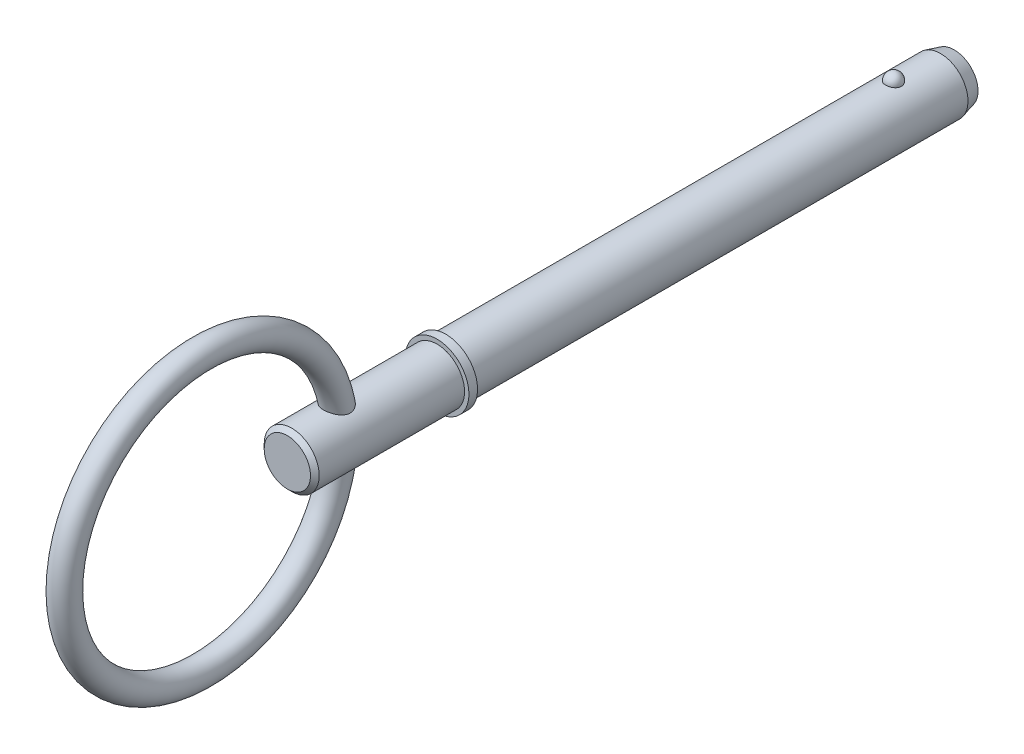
ISO-10303-21;
HEADER;
FILE_DESCRIPTION(('STEP AP214'),'2;1');
FILE_NAME('part.step','',(''),(''),'','','');
FILE_SCHEMA(('AUTOMOTIVE_DESIGN { 1 0 10303 214 1 1 1 1 }'));
ENDSEC;
DATA;
#1=APPLICATION_CONTEXT('core data for automotive mechanical design processes');
#2=APPLICATION_PROTOCOL_DEFINITION('international standard','automotive_design',2000,#1);
#3=PRODUCT_CONTEXT('',#1,'mechanical');
#4=PRODUCT('Part','Part','',(#3));
#5=PRODUCT_RELATED_PRODUCT_CATEGORY('part','',(#4));
#6=PRODUCT_DEFINITION_FORMATION('','',#4);
#7=PRODUCT_DEFINITION_CONTEXT('part definition',#1,'design');
#8=PRODUCT_DEFINITION('design','',#6,#7);
#9=PRODUCT_DEFINITION_SHAPE('','',#8);
#10=(LENGTH_UNIT() NAMED_UNIT(*) SI_UNIT(.MILLI.,.METRE.));
#11=(NAMED_UNIT(*) PLANE_ANGLE_UNIT() SI_UNIT($,.RADIAN.));
#12=(NAMED_UNIT(*) SI_UNIT($,.STERADIAN.) SOLID_ANGLE_UNIT());
#13=UNCERTAINTY_MEASURE_WITH_UNIT(LENGTH_MEASURE(1.E-05),#10,'distance_accuracy_value','');
#14=(GEOMETRIC_REPRESENTATION_CONTEXT(3) GLOBAL_UNCERTAINTY_ASSIGNED_CONTEXT((#13)) GLOBAL_UNIT_ASSIGNED_CONTEXT((#10,
#11,#12)) REPRESENTATION_CONTEXT('',''));
#15=CARTESIAN_POINT('',(0.,0.,0.));
#16=DIRECTION('',(0.,0.,1.));
#17=DIRECTION('',(1.,0.,0.));
#18=AXIS2_PLACEMENT_3D('',#15,#16,#17);
#19=CARTESIAN_POINT('',(0.,0.,50.8));
#20=DIRECTION('',(0.,0.,-1.));
#21=DIRECTION('',(-1.,0.,0.));
#22=AXIS2_PLACEMENT_3D('',#19,#20,#21);
#23=CYLINDRICAL_SURFACE('',#22,3.175);
#24=CARTESIAN_POINT('',(0.90060722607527,3.0445905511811,-0.91));
#25=CARTESIAN_POINT('',(0.90060646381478,3.04459122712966,-0.859144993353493));
#26=CARTESIAN_POINT('',(0.896466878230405,3.04582460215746,-0.808280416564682));
#27=CARTESIAN_POINT('',(0.88000740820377,3.05062019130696,-0.707994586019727));
#28=CARTESIAN_POINT('',(0.86768478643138,3.05418318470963,-0.658573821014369));
#29=CARTESIAN_POINT('',(0.835170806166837,3.06323316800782,-0.56260427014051));
#30=CARTESIAN_POINT('',(0.814982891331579,3.0687193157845,-0.516054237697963));
#31=CARTESIAN_POINT('',(0.767236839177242,3.08100268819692,-0.427093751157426));
#32=CARTESIAN_POINT('',(0.739678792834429,3.08779989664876,-0.38468324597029));
#33=CARTESIAN_POINT('',(0.677715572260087,3.10198953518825,-0.304951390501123));
#34=CARTESIAN_POINT('',(0.643275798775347,3.10938485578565,-0.267657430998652));
#35=CARTESIAN_POINT('',(0.568522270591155,3.12391647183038,-0.199446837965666));
#36=CARTESIAN_POINT('',(0.528208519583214,3.13105276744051,-0.16853020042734));
#37=CARTESIAN_POINT('',(0.442911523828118,3.14425008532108,-0.114021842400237));
#38=CARTESIAN_POINT('',(0.397942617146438,3.15031426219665,-0.0904084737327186));
#39=CARTESIAN_POINT('',(0.304493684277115,3.16071443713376,-0.0510610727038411));
#40=CARTESIAN_POINT('',(0.256014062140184,3.1650506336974,-0.0353261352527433));
#41=CARTESIAN_POINT('',(0.15789136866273,3.17144549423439,-0.01241518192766));
#42=CARTESIAN_POINT('',(0.108287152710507,3.1735453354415,-0.00508422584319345));
#43=CARTESIAN_POINT('',(0.0085070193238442,3.17538048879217,0.00133254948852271));
#44=CARTESIAN_POINT('',(-0.0416688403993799,3.17511603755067,0.0004191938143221));
#45=CARTESIAN_POINT('',(-0.140377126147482,3.17227395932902,-0.00954840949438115));
#46=CARTESIAN_POINT('',(-0.188922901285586,3.16973088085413,-0.018481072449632));
#47=CARTESIAN_POINT('',(-0.283780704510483,3.16265029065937,-0.044065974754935));
#48=CARTESIAN_POINT('',(-0.330092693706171,3.15811274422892,-0.0607183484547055));
#49=CARTESIAN_POINT('',(-0.419493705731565,3.1474895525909,-0.101406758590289));
#50=CARTESIAN_POINT('',(-0.462561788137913,3.14139480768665,-0.125486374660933));
#51=CARTESIAN_POINT('',(-0.54404237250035,3.12831396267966,-0.180346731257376));
#52=CARTESIAN_POINT('',(-0.582454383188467,3.12132776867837,-0.211128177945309));
#53=CARTESIAN_POINT('',(-0.654371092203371,3.10705591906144,-0.279257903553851));
#54=CARTESIAN_POINT('',(-0.687763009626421,3.09976707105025,-0.316724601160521));
#55=CARTESIAN_POINT('',(-0.747869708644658,3.08581767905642,-0.396782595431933));
#56=CARTESIAN_POINT('',(-0.774583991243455,3.07915718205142,-0.43937427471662));
#57=CARTESIAN_POINT('',(-0.820959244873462,3.06712152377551,-0.529074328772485));
#58=CARTESIAN_POINT('',(-0.840531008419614,3.06176288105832,-0.576231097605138));
#59=CARTESIAN_POINT('',(-0.871672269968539,3.0530437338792,-0.673291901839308));
#60=CARTESIAN_POINT('',(-0.883242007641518,3.04968316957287,-0.723195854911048));
#61=CARTESIAN_POINT('',(-0.898057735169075,3.04535343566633,-0.824104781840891));
#62=CARTESIAN_POINT('',(-0.901339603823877,3.04437395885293,-0.875104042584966));
#63=CARTESIAN_POINT('',(-0.89960137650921,3.04488803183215,-0.976947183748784));
#64=CARTESIAN_POINT('',(-0.894581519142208,3.04638151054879,-1.02779106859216));
#65=CARTESIAN_POINT('',(-0.876414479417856,3.051656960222,-1.12760218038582));
#66=CARTESIAN_POINT('',(-0.863310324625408,3.05542681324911,-1.17657789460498));
#67=CARTESIAN_POINT('',(-0.82933491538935,3.06482253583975,-1.27156757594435));
#68=CARTESIAN_POINT('',(-0.808463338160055,3.07044848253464,-1.31758141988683));
#69=CARTESIAN_POINT('',(-0.759325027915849,3.08296842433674,-1.40563218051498));
#70=CARTESIAN_POINT('',(-0.731017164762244,3.08986940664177,-1.44764515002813));
#71=CARTESIAN_POINT('',(-0.667767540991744,3.10415201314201,-1.52624913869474));
#72=CARTESIAN_POINT('',(-0.632825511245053,3.11153365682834,-1.56283993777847));
#73=CARTESIAN_POINT('',(-0.557049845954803,3.12598962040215,-1.62972906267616));
#74=CARTESIAN_POINT('',(-0.516193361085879,3.13306260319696,-1.66000181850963));
#75=CARTESIAN_POINT('',(-0.42979268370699,3.14607829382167,-1.7132172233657));
#76=CARTESIAN_POINT('',(-0.384248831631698,3.15202108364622,-1.73616040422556));
#77=CARTESIAN_POINT('',(-0.290370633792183,3.16204171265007,-1.77380927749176));
#78=CARTESIAN_POINT('',(-0.242079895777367,3.16614263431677,-1.7886174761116));
#79=CARTESIAN_POINT('',(-0.14357928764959,3.17213528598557,-1.81001390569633));
#80=CARTESIAN_POINT('',(-0.0933696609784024,3.1740272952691,-1.81660317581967));
#81=CARTESIAN_POINT('',(0.00648182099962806,3.17537830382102,-1.82132177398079));
#82=CARTESIAN_POINT('',(0.0561153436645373,3.17488455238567,-1.81961539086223));
#83=CARTESIAN_POINT('',(0.154368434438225,3.1716260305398,-1.80816900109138));
#84=CARTESIAN_POINT('',(0.202988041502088,3.16886134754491,-1.79842930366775));
#85=CARTESIAN_POINT('',(0.29764238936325,3.16137318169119,-1.77125024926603));
#86=CARTESIAN_POINT('',(0.343686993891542,3.15665785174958,-1.75384292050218));
#87=CARTESIAN_POINT('',(0.432167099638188,3.14576631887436,-1.71181408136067));
#88=CARTESIAN_POINT('',(0.474602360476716,3.13959001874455,-1.68719209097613));
#89=CARTESIAN_POINT('',(0.555408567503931,3.1263159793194,-1.63094218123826));
#90=CARTESIAN_POINT('',(0.593703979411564,3.11920512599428,-1.59920888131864));
#91=CARTESIAN_POINT('',(0.664472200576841,3.10490064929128,-1.52981493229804));
#92=CARTESIAN_POINT('',(0.696944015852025,3.09770701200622,-1.49215327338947));
#93=CARTESIAN_POINT('',(0.755798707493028,3.08388169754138,-1.41116434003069));
#94=CARTESIAN_POINT('',(0.782059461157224,3.07726269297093,-1.36774610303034));
#95=CARTESIAN_POINT('',(0.827051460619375,3.06547790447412,-1.27699966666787));
#96=CARTESIAN_POINT('',(0.845785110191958,3.06031165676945,-1.22967272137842));
#97=CARTESIAN_POINT('',(0.873798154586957,3.05242388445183,-1.13728658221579));
#98=CARTESIAN_POINT('',(0.883833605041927,3.04951005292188,-1.09247132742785));
#99=CARTESIAN_POINT('',(0.897238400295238,3.0455931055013,-1.00177329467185));
#100=CARTESIAN_POINT('',(0.900607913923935,3.0445899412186,-0.955890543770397));
#101=CARTESIAN_POINT('',(0.90060722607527,3.0445905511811,-0.91));
#102=B_SPLINE_CURVE_WITH_KNOTS('',3,(#24,#25,#26,#27,#28,#29,#30,#31,#32,#33,#34,#35,#36,#37,
#38,#39,#40,#41,#42,#43,#44,#45,#46,#47,#48,#49,#50,#51,#52,#53,#54,#55,#56,#57,#58,#59,#60,#61,
#62,#63,#64,#65,#66,#67,#68,#69,#70,#71,#72,#73,#74,#75,#76,#77,#78,#79,#80,#81,#82,#83,#84,#85,
#86,#87,#88,#89,#90,#91,#92,#93,#94,#95,#96,#97,#98,#99,#100,#101),.UNSPECIFIED.,.T.,.F.,(4,2,2,
2,2,2,2,2,2,2,2,2,2,2,2,2,2,2,2,2,2,2,2,2,2,2,2,2,2,2,2,2,2,2,2,2,2,2,4),(0.,0.152400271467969,
0.304851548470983,0.45723615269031,0.609618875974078,0.762787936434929,0.915956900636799,
1.06866739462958,1.22136034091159,1.37119044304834,1.52100555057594,1.66858689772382,
1.81617081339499,1.9646377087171,2.1131202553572,2.26455561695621,2.41600229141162,
2.5692805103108,2.72255413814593,2.87516308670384,3.02776764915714,3.1795669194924,
3.33137249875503,3.48403607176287,3.63670583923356,3.78998198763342,3.94324701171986,
4.09453370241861,4.24580126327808,4.39408543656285,4.5423639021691,4.69002878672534,
4.83770349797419,4.9877312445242,5.13778457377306,5.29058018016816,5.44332695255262,
5.58085340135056,5.71837636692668),.UNSPECIFIED.);
#103=CARTESIAN_POINT('',(0.90060722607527,3.0445905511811,-0.91));
#104=VERTEX_POINT('',#103);
#105=EDGE_CURVE('E100',#104,#104,#102,.T.);
#106=ORIENTED_EDGE('',*,*,#105,.T.);
#107=EDGE_LOOP('',(#106));
#108=FACE_BOUND('',#107,.T.);
#109=CARTESIAN_POINT('',(0.,0.,-6.33399999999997));
#110=DIRECTION('',(0.,0.,-1.));
#111=DIRECTION('',(-1.,0.,0.));
#112=AXIS2_PLACEMENT_3D('',#109,#110,#111);
#113=CIRCLE('',#112,3.175);
#114=CARTESIAN_POINT('',(-3.175,0.,-6.33399999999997));
#115=VERTEX_POINT('',#114);
#116=EDGE_CURVE('E108',#115,#115,#113,.F.);
#117=ORIENTED_EDGE('',*,*,#116,.T.);
#118=EDGE_LOOP('',(#117));
#119=FACE_BOUND('',#118,.T.);
#120=CARTESIAN_POINT('',(0.,0.,50.8));
#121=DIRECTION('',(0.,0.,1.));
#122=DIRECTION('',(1.,0.,0.));
#123=AXIS2_PLACEMENT_3D('',#120,#121,#122);
#124=CIRCLE('',#123,3.175);
#125=CARTESIAN_POINT('',(3.175,0.,50.8));
#126=VERTEX_POINT('',#125);
#127=EDGE_CURVE('E106',#126,#126,#124,.T.);
#128=ORIENTED_EDGE('',*,*,#127,.F.);
#129=EDGE_LOOP('',(#128));
#130=FACE_BOUND('',#129,.T.);
#131=ADVANCED_FACE('F39',(#108,#119,#130),#23,.T.);
#132=CARTESIAN_POINT('',(0.,0.,-7.92));
#133=DIRECTION('',(0.,0.,-1.));
#134=DIRECTION('',(-1.,0.,0.));
#135=AXIS2_PLACEMENT_3D('',#132,#133,#134);
#136=PLANE('',#135);
#137=CARTESIAN_POINT('',(0.,0.,-7.92));
#138=DIRECTION('',(0.,0.,-1.));
#139=DIRECTION('',(-1.,0.,0.));
#140=AXIS2_PLACEMENT_3D('',#137,#138,#139);
#141=CIRCLE('',#140,2.75003258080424);
#142=CARTESIAN_POINT('',(-2.75003258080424,0.,-7.92));
#143=VERTEX_POINT('',#142);
#144=EDGE_CURVE('E142',#143,#143,#141,.T.);
#145=ORIENTED_EDGE('',*,*,#144,.T.);
#146=EDGE_LOOP('',(#145));
#147=FACE_BOUND('',#146,.T.);
#148=ADVANCED_FACE('F86',(#147),#136,.T.);
#149=CARTESIAN_POINT('',(0.,0.,-7.92));
#150=DIRECTION('',(0.,0.,1.));
#151=DIRECTION('',(1.,0.,0.));
#152=AXIS2_PLACEMENT_3D('',#149,#150,#151);
#153=CONICAL_SURFACE('',#152,2.75003258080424,0.261799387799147);
#154=ORIENTED_EDGE('',*,*,#116,.F.);
#155=EDGE_LOOP('',(#154));
#156=FACE_BOUND('',#155,.T.);
#157=ORIENTED_EDGE('',*,*,#144,.F.);
#158=EDGE_LOOP('',(#157));
#159=FACE_BOUND('',#158,.T.);
#160=ADVANCED_FACE('F92',(#156,#159),#153,.T.);
#161=CARTESIAN_POINT('',(0.,3.175,-0.91));
#162=DIRECTION('',(0.,1.,0.));
#163=DIRECTION('',(0.,0.,-1.));
#164=AXIS2_PLACEMENT_3D('',#161,#162,#163);
#165=SPHERICAL_SURFACE('',#164,0.91);
#166=ORIENTED_EDGE('',*,*,#105,.F.);
#167=EDGE_LOOP('',(#166));
#168=FACE_BOUND('',#167,.T.);
#169=ADVANCED_FACE('F111',(#168),#165,.T.);
#170=CARTESIAN_POINT('',(0.,0.,50.8));
#171=DIRECTION('',(0.,0.,-1.));
#172=DIRECTION('',(-1.,0.,0.));
#173=AXIS2_PLACEMENT_3D('',#170,#171,#172);
#174=PLANE('',#173);
#175=ORIENTED_EDGE('',*,*,#127,.T.);
#176=EDGE_LOOP('',(#175));
#177=FACE_BOUND('',#176,.T.);
#178=CARTESIAN_POINT('',(0.,0.,50.8));
#179=DIRECTION('',(0.,0.,-1.));
#180=DIRECTION('',(-1.,0.,0.));
#181=AXIS2_PLACEMENT_3D('',#178,#179,#180);
#182=CIRCLE('',#181,3.675);
#183=CARTESIAN_POINT('',(-3.675,0.,50.8));
#184=VERTEX_POINT('',#183);
#185=EDGE_CURVE('E107',#184,#184,#182,.T.);
#186=ORIENTED_EDGE('',*,*,#185,.T.);
#187=EDGE_LOOP('',(#186));
#188=FACE_BOUND('',#187,.T.);
#189=ADVANCED_FACE('F115',(#177,#188),#174,.T.);
#190=CARTESIAN_POINT('',(0.,0.,33.7287874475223));
#191=DIRECTION('',(0.,0.,-1.));
#192=DIRECTION('',(-1.,0.,0.));
#193=AXIS2_PLACEMENT_3D('',#190,#191,#192);
#194=CYLINDRICAL_SURFACE('',#193,3.675);
#195=CARTESIAN_POINT('',(0.,0.,51.8));
#196=DIRECTION('',(0.,0.,-1.));
#197=DIRECTION('',(-1.,0.,0.));
#198=AXIS2_PLACEMENT_3D('',#195,#196,#197);
#199=CIRCLE('',#198,3.675);
#200=CARTESIAN_POINT('',(-3.675,0.,51.8));
#201=VERTEX_POINT('',#200);
#202=EDGE_CURVE('E132',#201,#201,#199,.T.);
#203=ORIENTED_EDGE('',*,*,#202,.T.);
#204=EDGE_LOOP('',(#203));
#205=FACE_BOUND('',#204,.T.);
#206=ORIENTED_EDGE('',*,*,#185,.F.);
#207=EDGE_LOOP('',(#206));
#208=FACE_BOUND('',#207,.T.);
#209=ADVANCED_FACE('F119',(#205,#208),#194,.T.);
#210=CARTESIAN_POINT('',(0.,3.675,51.8));
#211=DIRECTION('',(0.,0.,1.));
#212=DIRECTION('',(1.,0.,0.));
#213=AXIS2_PLACEMENT_3D('',#210,#211,#212);
#214=PLANE('',#213);
#215=CARTESIAN_POINT('',(0.,0.,51.8));
#216=DIRECTION('',(0.,0.,1.));
#217=DIRECTION('',(1.,0.,0.));
#218=AXIS2_PLACEMENT_3D('',#215,#216,#217);
#219=CIRCLE('',#218,3.175);
#220=CARTESIAN_POINT('',(3.175,0.,51.8));
#221=VERTEX_POINT('',#220);
#222=EDGE_CURVE('E110',#221,#221,#219,.T.);
#223=ORIENTED_EDGE('',*,*,#222,.F.);
#224=EDGE_LOOP('',(#223));
#225=FACE_BOUND('',#224,.T.);
#226=ORIENTED_EDGE('',*,*,#202,.F.);
#227=EDGE_LOOP('',(#226));
#228=FACE_BOUND('',#227,.T.);
#229=ADVANCED_FACE('F83',(#225,#228),#214,.T.);
#230=CARTESIAN_POINT('',(0.,0.,69.09));
#231=DIRECTION('',(0.,0.,-1.));
#232=DIRECTION('',(-1.,0.,0.));
#233=AXIS2_PLACEMENT_3D('',#230,#231,#232);
#234=CYLINDRICAL_SURFACE('',#233,3.175);
#235=CARTESIAN_POINT('',(-0.793622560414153,-3.07421343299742,62.0949618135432));
#236=CARTESIAN_POINT('',(-0.723928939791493,-3.09220199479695,62.0540743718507));
#237=CARTESIAN_POINT('',(-0.650537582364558,-3.10860299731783,62.0186572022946));
#238=CARTESIAN_POINT('',(-0.49822561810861,-3.13662262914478,61.95960803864));
#239=CARTESIAN_POINT('',(-0.419299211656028,-3.14823615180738,61.935988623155));
#240=CARTESIAN_POINT('',(-0.2580224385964,-3.16553731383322,61.9011787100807));
#241=CARTESIAN_POINT('',(-0.175668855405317,-3.17121924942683,61.8900001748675));
#242=CARTESIAN_POINT('',(-0.0100583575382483,-3.17606405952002,61.8804538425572));
#243=CARTESIAN_POINT('',(0.0731982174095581,-3.17522930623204,61.8820813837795));
#244=CARTESIAN_POINT('',(0.236345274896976,-3.16722178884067,61.8979075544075));
#245=CARTESIAN_POINT('',(0.316269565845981,-3.16018772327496,61.9118310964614));
#246=CARTESIAN_POINT('',(0.472429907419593,-3.14064183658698,61.9514871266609));
#247=CARTESIAN_POINT('',(0.548665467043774,-3.12812928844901,61.9772211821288));
#248=CARTESIAN_POINT('',(0.696533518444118,-3.0985857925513,62.0403145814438));
#249=CARTESIAN_POINT('',(0.768085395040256,-3.08149328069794,62.0778336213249));
#250=CARTESIAN_POINT('',(0.90366694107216,-3.04449595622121,62.163584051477));
#251=CARTESIAN_POINT('',(0.967693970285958,-3.02459016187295,62.2118191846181));
#252=CARTESIAN_POINT('',(1.08889306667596,-2.98315111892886,62.3200855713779));
#253=CARTESIAN_POINT('',(1.14572430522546,-2.96158491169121,62.3804869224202));
#254=CARTESIAN_POINT('',(1.24806454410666,-2.91993487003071,62.5106874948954));
#255=CARTESIAN_POINT('',(1.29357550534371,-2.89985077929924,62.5804850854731));
#256=CARTESIAN_POINT('',(1.37094214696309,-2.86407549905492,62.7262600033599));
#257=CARTESIAN_POINT('',(1.40307792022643,-2.84829687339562,62.8020662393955));
#258=CARTESIAN_POINT('',(1.45397574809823,-2.82265933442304,62.9589553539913));
#259=CARTESIAN_POINT('',(1.47274938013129,-2.81279529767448,63.0400335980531));
#260=CARTESIAN_POINT('',(1.49549698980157,-2.80076108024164,63.1979026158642));
#261=CARTESIAN_POINT('',(1.50056337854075,-2.79802369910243,63.2744958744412));
#262=CARTESIAN_POINT('',(1.49933665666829,-2.79868066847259,63.4275541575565));
#263=CARTESIAN_POINT('',(1.49304097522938,-2.80207640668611,63.5040191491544));
#264=CARTESIAN_POINT('',(1.46976618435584,-2.81435249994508,63.6552802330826));
#265=CARTESIAN_POINT('',(1.45272287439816,-2.82326580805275,63.7300634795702));
#266=CARTESIAN_POINT('',(1.40884990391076,-2.84541139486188,63.8760088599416));
#267=CARTESIAN_POINT('',(1.38201642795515,-2.85864535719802,63.9471695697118));
#268=CARTESIAN_POINT('',(1.31496449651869,-2.89016475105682,64.0946079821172));
#269=CARTESIAN_POINT('',(1.27338339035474,-2.90890132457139,64.1701693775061));
#270=CARTESIAN_POINT('',(1.17952729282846,-2.94820796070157,64.3139034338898));
#271=CARTESIAN_POINT('',(1.12723913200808,-2.96878026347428,64.3820668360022));
#272=CARTESIAN_POINT('',(1.00570728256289,-3.01228109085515,64.5173106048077));
#273=CARTESIAN_POINT('',(0.935174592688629,-3.03519170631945,64.5832498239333));
#274=CARTESIAN_POINT('',(0.782605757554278,-3.07805054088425,64.701321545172));
#275=CARTESIAN_POINT('',(0.700588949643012,-3.09800362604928,64.7534768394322));
#276=CARTESIAN_POINT('',(0.549003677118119,-3.12787153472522,64.8296423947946));
#277=CARTESIAN_POINT('',(0.481582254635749,-3.1390487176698,64.8574376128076));
#278=CARTESIAN_POINT('',(0.34269622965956,-3.15722518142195,64.9021563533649));
#279=CARTESIAN_POINT('',(0.271235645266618,-3.16422853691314,64.9190904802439));
#280=CARTESIAN_POINT('',(0.125873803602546,-3.17334230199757,64.9410622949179));
#281=CARTESIAN_POINT('',(0.0519637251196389,-3.17543249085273,64.9460508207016));
#282=CARTESIAN_POINT('',(-0.0956207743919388,-3.17441743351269,64.9436180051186));
#283=CARTESIAN_POINT('',(-0.169295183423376,-3.1713119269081,64.9361960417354));
#284=CARTESIAN_POINT('',(-0.309449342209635,-3.16061694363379,64.9103375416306));
#285=CARTESIAN_POINT('',(-0.376089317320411,-3.15332372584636,64.8926279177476));
#286=CARTESIAN_POINT('',(-0.505583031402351,-3.13517004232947,64.8477876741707));
#287=CARTESIAN_POINT('',(-0.568435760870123,-3.12430863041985,64.8206545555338));
#288=CARTESIAN_POINT('',(-0.694306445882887,-3.09887452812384,64.7555626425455));
#289=CARTESIAN_POINT('',(-0.7569075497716,-3.08406907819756,64.7168937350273));
#290=CARTESIAN_POINT('',(-0.875645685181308,-3.05248288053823,64.6313455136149));
#291=CARTESIAN_POINT('',(-0.931779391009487,-3.03570112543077,64.5844620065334));
#292=CARTESIAN_POINT('',(-1.0463923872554,-2.99832170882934,64.4747926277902));
#293=CARTESIAN_POINT('',(-1.10353654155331,-2.97757338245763,64.4106605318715));
#294=CARTESIAN_POINT('',(-1.20755858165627,-2.93692907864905,64.2742268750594));
#295=CARTESIAN_POINT('',(-1.25442453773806,-2.91703411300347,64.2019159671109));
#296=CARTESIAN_POINT('',(-1.34199791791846,-2.87788786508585,64.0412794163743));
#297=CARTESIAN_POINT('',(-1.38127718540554,-2.85900475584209,63.9520744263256));
#298=CARTESIAN_POINT('',(-1.44406659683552,-2.82781619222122,63.7671839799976));
#299=CARTESIAN_POINT('',(-1.46759319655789,-2.81550387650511,63.6715054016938));
#300=CARTESIAN_POINT('',(-1.49571801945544,-2.8006591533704,63.4845771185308));
#301=CARTESIAN_POINT('',(-1.50169726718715,-2.79741422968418,63.3935980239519));
#302=CARTESIAN_POINT('',(-1.49747735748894,-2.79967890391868,63.2121564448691));
#303=CARTESIAN_POINT('',(-1.48729863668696,-2.80517744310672,63.1216934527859));
#304=CARTESIAN_POINT('',(-1.45348639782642,-2.82281521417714,62.9584626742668));
#305=CARTESIAN_POINT('',(-1.43212237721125,-2.83382344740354,62.885088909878));
#306=CARTESIAN_POINT('',(-1.37828411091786,-2.86039426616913,62.7433903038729));
#307=CARTESIAN_POINT('',(-1.34580440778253,-2.87595908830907,62.6750679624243));
#308=CARTESIAN_POINT('',(-1.27066760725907,-2.90993532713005,62.5450336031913));
#309=CARTESIAN_POINT('',(-1.22800357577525,-2.92834868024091,62.483326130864));
#310=CARTESIAN_POINT('',(-1.13363307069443,-2.96615489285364,62.3677083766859));
#311=CARTESIAN_POINT('',(-1.08193541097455,-2.98554678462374,62.3137905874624));
#312=CARTESIAN_POINT('',(-0.990573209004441,-3.01675653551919,62.2323094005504));
#313=CARTESIAN_POINT('',(-0.95320938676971,-3.02880489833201,62.2022130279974));
#314=CARTESIAN_POINT('',(-0.875544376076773,-3.0521621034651,62.1457477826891));
#315=CARTESIAN_POINT('',(-0.83524283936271,-3.06347085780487,62.1193793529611));
#316=CARTESIAN_POINT('',(-0.793622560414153,-3.07421343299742,62.0949618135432));
#317=B_SPLINE_CURVE_WITH_KNOTS('',3,(#235,#236,#237,#238,#239,#240,#241,#242,#243,#244,#245,
#246,#247,#248,#249,#250,#251,#252,#253,#254,#255,#256,#257,#258,#259,#260,#261,#262,#263,#264,
#265,#266,#267,#268,#269,#270,#271,#272,#273,#274,#275,#276,#277,#278,#279,#280,#281,#282,#283,
#284,#285,#286,#287,#288,#289,#290,#291,#292,#293,#294,#295,#296,#297,#298,#299,#300,#301,#302,
#303,#304,#305,#306,#307,#308,#309,#310,#311,#312,#313,#314,#315,#316),.UNSPECIFIED.,.T.,.F.,(4,
2,2,2,2,2,2,2,2,2,2,2,2,2,2,2,2,2,2,2,2,2,2,2,2,2,2,2,2,2,2,2,2,2,2,2,2,2,2,2,4),(0.,
0.248167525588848,0.496599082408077,0.745269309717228,0.993849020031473,1.23700449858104,
1.48019225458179,1.7268289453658,1.97355191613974,2.22939388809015,2.48519151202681,
2.73532416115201,2.98523982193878,3.21455414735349,3.44392036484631,3.67466984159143,
3.90550934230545,4.16925064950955,4.43331832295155,4.72951976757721,5.02522832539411,
5.24564983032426,5.46585579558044,5.68696647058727,5.9080882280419,6.11521387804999,
6.32239449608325,6.54672206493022,6.77116447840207,7.03522663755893,7.29959368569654,
7.59590092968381,7.89189815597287,8.16387683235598,8.43551178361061,8.6660355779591,
8.89667271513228,9.12746733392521,9.35803801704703,9.50622339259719,9.6544263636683),.UNSPECIFIED.);
#318=CARTESIAN_POINT('',(-0.793622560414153,-3.07421343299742,62.0949618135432));
#319=VERTEX_POINT('',#318);
#320=EDGE_CURVE('E10',#319,#319,#317,.T.);
#321=ORIENTED_EDGE('',*,*,#320,.F.);
#322=EDGE_LOOP('',(#321));
#323=FACE_BOUND('',#322,.T.);
#324=CARTESIAN_POINT('',(-0.793622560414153,3.07421343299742,62.0949618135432));
#325=CARTESIAN_POINT('',(-0.864606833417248,3.05588589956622,62.1366128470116));
#326=CARTESIAN_POINT('',(-0.931875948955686,3.03587991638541,62.1840114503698));
#327=CARTESIAN_POINT('',(-1.05725170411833,2.99453227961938,62.2893775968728));
#328=CARTESIAN_POINT('',(-1.11534118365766,2.97318822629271,62.3473645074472));
#329=CARTESIAN_POINT('',(-1.22080462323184,2.93146441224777,62.472887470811));
#330=CARTESIAN_POINT('',(-1.26816209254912,2.91108617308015,62.5404379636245));
#331=CARTESIAN_POINT('',(-1.35052787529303,2.87380473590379,62.6835086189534));
#332=CARTESIAN_POINT('',(-1.38554886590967,2.85689797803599,62.7590204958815));
#333=CARTESIAN_POINT('',(-1.44074287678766,2.82945202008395,62.9122947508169));
#334=CARTESIAN_POINT('',(-1.46153301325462,2.81865228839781,62.9897872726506));
#335=CARTESIAN_POINT('',(-1.49023441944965,2.80358650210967,63.1477206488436));
#336=CARTESIAN_POINT('',(-1.49815016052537,2.79931817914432,63.2281604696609));
#337=CARTESIAN_POINT('',(-1.50117056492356,2.79769676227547,63.3840076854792));
#338=CARTESIAN_POINT('',(-1.49708260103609,2.79990784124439,63.4593985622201));
#339=CARTESIAN_POINT('',(-1.4784698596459,2.80977909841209,63.6084983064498));
#340=CARTESIAN_POINT('',(-1.46394166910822,2.8174410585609,63.6822066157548));
#341=CARTESIAN_POINT('',(-1.42400377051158,2.83784609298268,63.8313443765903));
#342=CARTESIAN_POINT('',(-1.39791960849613,2.85090002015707,63.9065484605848));
#343=CARTESIAN_POINT('',(-1.33585690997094,2.8805017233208,64.0520384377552));
#344=CARTESIAN_POINT('',(-1.29987052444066,2.89705226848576,64.1223203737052));
#345=CARTESIAN_POINT('',(-1.21229019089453,2.93489412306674,64.2677405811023));
#346=CARTESIAN_POINT('',(-1.15911759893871,2.95651988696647,64.3418449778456));
#347=CARTESIAN_POINT('',(-1.04143166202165,2.99999612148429,64.4803805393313));
#348=CARTESIAN_POINT('',(-0.976918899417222,3.0218465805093,64.544812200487));
#349=CARTESIAN_POINT('',(-0.84536841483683,3.06106710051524,64.6552302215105));
#350=CARTESIAN_POINT('',(-0.779466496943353,3.0786636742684,64.7024840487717));
#351=CARTESIAN_POINT('',(-0.640261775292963,3.11059085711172,64.7859540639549));
#352=CARTESIAN_POINT('',(-0.566963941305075,3.12492363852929,64.8221775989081));
#353=CARTESIAN_POINT('',(-0.413802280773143,3.14887886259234,64.8818109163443));
#354=CARTESIAN_POINT('',(-0.333888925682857,3.15846114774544,64.9051116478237));
#355=CARTESIAN_POINT('',(-0.170660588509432,3.17146222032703,64.9365717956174));
#356=CARTESIAN_POINT('',(-0.087349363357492,3.17488763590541,64.9447474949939));
#357=CARTESIAN_POINT('',(0.0674621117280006,3.17509166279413,64.9452317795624));
#358=CARTESIAN_POINT('',(0.138963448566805,3.17274321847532,64.9396242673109));
#359=CARTESIAN_POINT('',(0.279855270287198,3.16342998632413,64.9171581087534));
#360=CARTESIAN_POINT('',(0.349245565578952,3.15646478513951,64.9002984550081));
#361=CARTESIAN_POINT('',(0.483013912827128,3.13875920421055,64.8567119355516));
#362=CARTESIAN_POINT('',(0.547455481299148,3.12808257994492,64.8301513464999));
#363=CARTESIAN_POINT('',(0.671431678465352,3.10383639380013,64.7683782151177));
#364=CARTESIAN_POINT('',(0.730964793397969,3.09026594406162,64.7331630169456));
#365=CARTESIAN_POINT('',(0.852308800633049,3.05919023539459,64.6498716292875));
#366=CARTESIAN_POINT('',(0.913284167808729,3.04140021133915,64.6006877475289));
#367=CARTESIAN_POINT('',(1.0273242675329,3.00480015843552,64.4941850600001));
#368=CARTESIAN_POINT('',(1.08038247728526,2.98598930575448,64.4368596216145));
#369=CARTESIAN_POINT('',(1.18657794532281,2.94557646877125,64.3046952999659));
#370=CARTESIAN_POINT('',(1.23812372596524,2.92405810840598,64.2285445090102));
#371=CARTESIAN_POINT('',(1.32862928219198,2.88406370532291,64.0682796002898));
#372=CARTESIAN_POINT('',(1.36758013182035,2.86558982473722,63.9841598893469));
#373=CARTESIAN_POINT('',(1.43274280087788,2.83359383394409,63.8061421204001));
#374=CARTESIAN_POINT('',(1.45837682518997,2.82030175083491,63.7119863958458));
#375=CARTESIAN_POINT('',(1.49241322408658,2.80245006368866,63.5198495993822));
#376=CARTESIAN_POINT('',(1.50084951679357,2.79787327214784,63.4218764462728));
#377=CARTESIAN_POINT('',(1.49914798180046,2.79877932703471,63.2405073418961));
#378=CARTESIAN_POINT('',(1.49154990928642,2.80288682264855,63.157078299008));
#379=CARTESIAN_POINT('',(1.46253136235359,2.81813655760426,62.9933228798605));
#380=CARTESIAN_POINT('',(1.44111368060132,2.82927737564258,62.9129958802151));
#381=CARTESIAN_POINT('',(1.38785163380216,2.85574398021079,62.7657200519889));
#382=CARTESIAN_POINT('',(1.3572264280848,2.87055627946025,62.6982302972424));
#383=CARTESIAN_POINT('',(1.28612163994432,2.90310901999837,62.5694446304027));
#384=CARTESIAN_POINT('',(1.24564038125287,2.92084995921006,62.508149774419));
#385=CARTESIAN_POINT('',(1.1532082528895,2.95860856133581,62.3894756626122));
#386=CARTESIAN_POINT('',(1.10072548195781,2.97869868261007,62.3325343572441));
#387=CARTESIAN_POINT('',(0.98711836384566,3.01825121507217,62.2277702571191));
#388=CARTESIAN_POINT('',(0.925990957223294,3.03771340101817,62.1799507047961));
#389=CARTESIAN_POINT('',(0.792065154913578,3.07545294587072,62.0913571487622));
#390=CARTESIAN_POINT('',(0.718757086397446,3.0935612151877,62.0512781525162));
#391=CARTESIAN_POINT('',(0.565747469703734,3.12516438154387,61.9833730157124));
#392=CARTESIAN_POINT('',(0.486046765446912,3.13865988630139,61.9555452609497));
#393=CARTESIAN_POINT('',(0.323293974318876,3.15955163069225,61.9130890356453));
#394=CARTESIAN_POINT('',(0.240283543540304,3.16700771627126,61.8983309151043));
#395=CARTESIAN_POINT('',(0.0726303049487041,3.17527774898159,61.8819853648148));
#396=CARTESIAN_POINT('',(-0.012012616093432,3.17609123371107,61.8803988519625));
#397=CARTESIAN_POINT('',(-0.177340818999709,3.17108555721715,61.8902649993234));
#398=CARTESIAN_POINT('',(-0.258061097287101,3.16549698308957,61.9012643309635));
#399=CARTESIAN_POINT('',(-0.416230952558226,3.1486007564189,61.9352506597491));
#400=CARTESIAN_POINT('',(-0.493684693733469,3.13730063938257,61.9582218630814));
#401=CARTESIAN_POINT('',(-0.607599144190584,3.11657538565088,62.0018364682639));
#402=CARTESIAN_POINT('',(-0.645999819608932,3.10882447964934,62.0183691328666));
#403=CARTESIAN_POINT('',(-0.721122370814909,3.092262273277,62.0544352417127));
#404=CARTESIAN_POINT('',(-0.757844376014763,3.08345105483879,62.0739684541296));
#405=CARTESIAN_POINT('',(-0.793622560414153,3.07421343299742,62.0949618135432));
#406=B_SPLINE_CURVE_WITH_KNOTS('',3,(#324,#325,#326,#327,#328,#329,#330,#331,#332,#333,#334,
#335,#336,#337,#338,#339,#340,#341,#342,#343,#344,#345,#346,#347,#348,#349,#350,#351,#352,#353,
#354,#355,#356,#357,#358,#359,#360,#361,#362,#363,#364,#365,#366,#367,#368,#369,#370,#371,#372,
#373,#374,#375,#376,#377,#378,#379,#380,#381,#382,#383,#384,#385,#386,#387,#388,#389,#390,#391,
#392,#393,#394,#395,#396,#397,#398,#399,#400,#401,#402,#403,#404,#405),.UNSPECIFIED.,.T.,.F.,(4,
2,2,2,2,2,2,2,2,2,2,2,2,2,2,2,2,2,2,2,2,2,2,2,2,2,2,2,2,2,2,2,2,2,2,2,2,2,2,2,4),(0.,
0.252800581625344,0.506068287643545,0.759722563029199,1.01311541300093,1.25467278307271,
1.49614624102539,1.72175790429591,1.94744335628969,2.18851823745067,2.42978476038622,
2.70981318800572,2.98982723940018,3.23776482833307,3.48553690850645,3.73536921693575,
3.98493240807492,4.19913817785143,4.41336312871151,4.62407643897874,4.8348544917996,
5.07495869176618,5.31525962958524,5.59735778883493,5.87965543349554,6.1733501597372,
6.46646508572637,6.71664398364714,6.96677234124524,7.19253107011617,7.41832822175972,
7.6573166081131,7.89638978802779,8.15162793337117,8.40683243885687,8.65947601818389,
8.91213718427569,9.15597668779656,9.39949531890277,9.5269241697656,9.65434318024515),.UNSPECIFIED.);
#407=CARTESIAN_POINT('',(-0.793622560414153,3.07421343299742,62.0949618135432));
#408=VERTEX_POINT('',#407);
#409=EDGE_CURVE('E51',#408,#408,#406,.T.);
#410=ORIENTED_EDGE('',*,*,#409,.F.);
#411=EDGE_LOOP('',(#410));
#412=FACE_BOUND('',#411,.T.);
#413=CARTESIAN_POINT('',(0.,0.,68.59));
#414=DIRECTION('',(0.,0.,-1.));
#415=DIRECTION('',(-1.,0.,0.));
#416=AXIS2_PLACEMENT_3D('',#413,#414,#415);
#417=CIRCLE('',#416,3.175);
#418=CARTESIAN_POINT('',(-3.175,0.,68.59));
#419=VERTEX_POINT('',#418);
#420=EDGE_CURVE('E62',#419,#419,#417,.T.);
#421=ORIENTED_EDGE('',*,*,#420,.T.);
#422=EDGE_LOOP('',(#421));
#423=FACE_BOUND('',#422,.T.);
#424=ORIENTED_EDGE('',*,*,#222,.T.);
#425=EDGE_LOOP('',(#424));
#426=FACE_BOUND('',#425,.T.);
#427=ADVANCED_FACE('F67',(#323,#412,#423,#426),#234,.T.);
#428=CARTESIAN_POINT('',(0.,0.,69.09));
#429=DIRECTION('',(0.,0.,-1.));
#430=DIRECTION('',(-1.,0.,0.));
#431=AXIS2_PLACEMENT_3D('',#428,#429,#430);
#432=PLANE('',#431);
#433=CARTESIAN_POINT('',(0.,0.,69.09));
#434=DIRECTION('',(0.,0.,-1.));
#435=DIRECTION('',(-1.,0.,0.));
#436=AXIS2_PLACEMENT_3D('',#433,#434,#435);
#437=CIRCLE('',#436,2.67499999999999);
#438=CARTESIAN_POINT('',(-2.67499999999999,0.,69.09));
#439=VERTEX_POINT('',#438);
#440=EDGE_CURVE('E57',#439,#439,#437,.F.);
#441=ORIENTED_EDGE('',*,*,#440,.T.);
#442=EDGE_LOOP('',(#441));
#443=FACE_BOUND('',#442,.T.);
#444=ADVANCED_FACE('F74',(#443),#432,.F.);
#445=CARTESIAN_POINT('',(0.,0.,68.59));
#446=DIRECTION('',(0.,0.,-1.));
#447=DIRECTION('',(-1.,0.,0.));
#448=AXIS2_PLACEMENT_3D('',#445,#446,#447);
#449=CONICAL_SURFACE('',#448,3.175,0.785398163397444);
#450=ORIENTED_EDGE('',*,*,#440,.F.);
#451=EDGE_LOOP('',(#450));
#452=FACE_BOUND('',#451,.T.);
#453=ORIENTED_EDGE('',*,*,#420,.F.);
#454=EDGE_LOOP('',(#453));
#455=FACE_BOUND('',#454,.T.);
#456=ADVANCED_FACE('F41',(#452,#455),#449,.T.);
#457=CARTESIAN_POINT('',(0.,0.,78.965));
#458=DIRECTION('',(1.,0.,0.));
#459=DIRECTION('',(0.,0.,-1.));
#460=AXIS2_PLACEMENT_3D('',#457,#458,#459);
#461=TOROIDAL_SURFACE('',#460,15.875,1.5);
#462=ORIENTED_EDGE('',*,*,#320,.T.);
#463=EDGE_LOOP('',(#462));
#464=FACE_BOUND('',#463,.T.);
#465=ORIENTED_EDGE('',*,*,#409,.T.);
#466=EDGE_LOOP('',(#465));
#467=FACE_BOUND('',#466,.T.);
#468=ADVANCED_FACE('F71',(#464,#467),#461,.T.);
#469=CLOSED_SHELL('',(#131,#148,#160,#169,#189,#209,#229,#427,#444,#456,#468));
#470=MANIFOLD_SOLID_BREP('B2',#469);
#471=ADVANCED_BREP_SHAPE_REPRESENTATION('',(#18,#470),#14);
#472=SHAPE_DEFINITION_REPRESENTATION(#9,#471);
ENDSEC;
END-ISO-10303-21;
